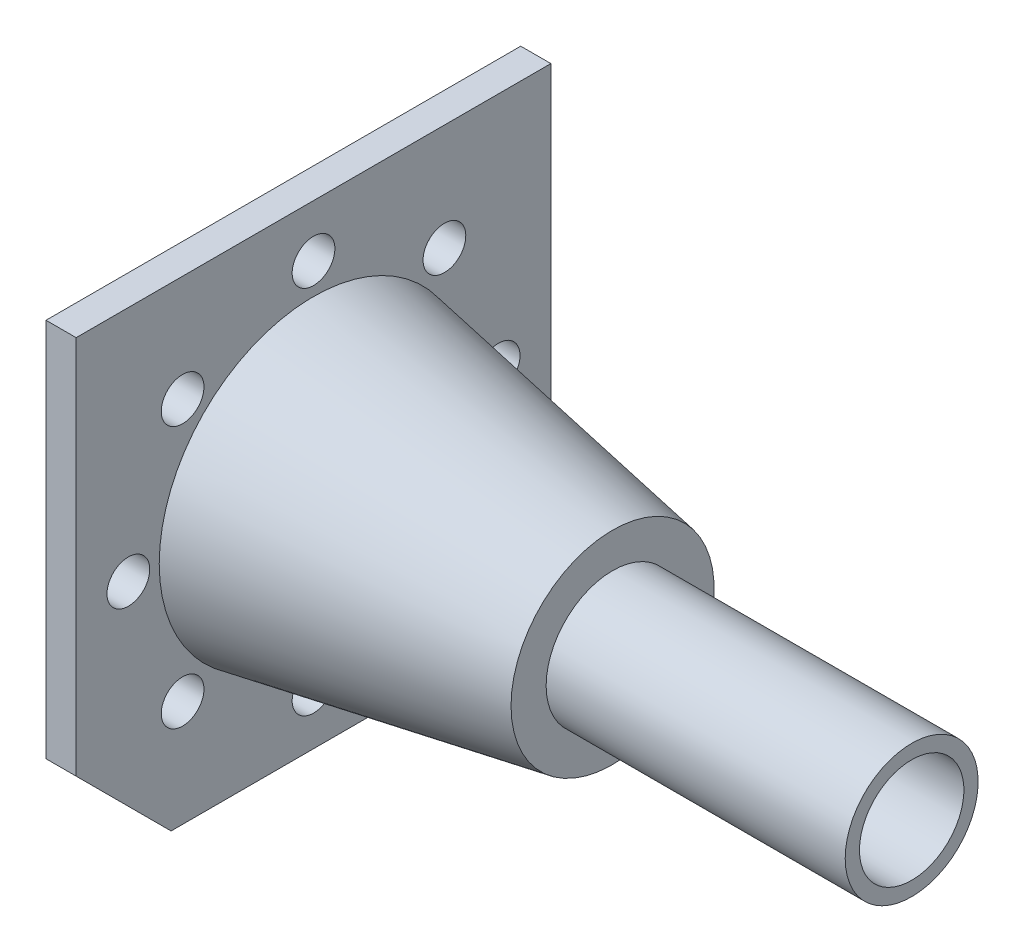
ISO-10303-21;
HEADER;
FILE_DESCRIPTION(('STEP AP214'),'2;1');
FILE_NAME('part.step','',(''),(''),'','','');
FILE_SCHEMA(('AUTOMOTIVE_DESIGN { 1 0 10303 214 1 1 1 1 }'));
ENDSEC;
DATA;
#1=APPLICATION_CONTEXT('core data for automotive mechanical design processes');
#2=APPLICATION_PROTOCOL_DEFINITION('international standard','automotive_design',2000,#1);
#3=PRODUCT_CONTEXT('',#1,'mechanical');
#4=PRODUCT('Part','Part','',(#3));
#5=PRODUCT_RELATED_PRODUCT_CATEGORY('part','',(#4));
#6=PRODUCT_DEFINITION_FORMATION('','',#4);
#7=PRODUCT_DEFINITION_CONTEXT('part definition',#1,'design');
#8=PRODUCT_DEFINITION('design','',#6,#7);
#9=PRODUCT_DEFINITION_SHAPE('','',#8);
#10=(LENGTH_UNIT() NAMED_UNIT(*) SI_UNIT(.MILLI.,.METRE.));
#11=(NAMED_UNIT(*) PLANE_ANGLE_UNIT() SI_UNIT($,.RADIAN.));
#12=(NAMED_UNIT(*) SI_UNIT($,.STERADIAN.) SOLID_ANGLE_UNIT());
#13=UNCERTAINTY_MEASURE_WITH_UNIT(LENGTH_MEASURE(1.E-05),#10,'distance_accuracy_value','');
#14=(GEOMETRIC_REPRESENTATION_CONTEXT(3) GLOBAL_UNCERTAINTY_ASSIGNED_CONTEXT((#13)) GLOBAL_UNIT_ASSIGNED_CONTEXT((#10,
#11,#12)) REPRESENTATION_CONTEXT('',''));
#15=CARTESIAN_POINT('',(0.,0.,0.));
#16=DIRECTION('',(0.,0.,1.));
#17=DIRECTION('',(1.,0.,0.));
#18=AXIS2_PLACEMENT_3D('',#15,#16,#17);
#19=CARTESIAN_POINT('',(6.35,-50.,50.));
#20=DIRECTION('',(0.,1.,0.));
#21=DIRECTION('',(0.,0.,1.));
#22=AXIS2_PLACEMENT_3D('',#19,#20,#21);
#23=PLANE('',#22);
#24=DIRECTION('',(0.,0.,-1.));
#25=VECTOR('',#24,1.);
#26=CARTESIAN_POINT('',(6.35,-50.,50.));
#27=LINE('',#26,#25);
#28=CARTESIAN_POINT('',(6.35,-50.,30.));
#29=VERTEX_POINT('',#28);
#30=CARTESIAN_POINT('',(6.35,-50.,-50.));
#31=VERTEX_POINT('',#30);
#32=EDGE_CURVE('E80',#29,#31,#27,.T.);
#33=ORIENTED_EDGE('',*,*,#32,.F.);
#34=DIRECTION('',(-1.,0.,0.));
#35=VECTOR('',#34,1.);
#36=CARTESIAN_POINT('',(6.35,-50.,30.));
#37=LINE('',#36,#35);
#38=CARTESIAN_POINT('',(0.,-50.,30.));
#39=VERTEX_POINT('',#38);
#40=EDGE_CURVE('E106',#29,#39,#37,.T.);
#41=ORIENTED_EDGE('',*,*,#40,.T.);
#42=DIRECTION('',(0.,0.,-1.));
#43=VECTOR('',#42,1.);
#44=CARTESIAN_POINT('',(0.,-50.,50.));
#45=LINE('',#44,#43);
#46=CARTESIAN_POINT('',(0.,-50.,-50.));
#47=VERTEX_POINT('',#46);
#48=EDGE_CURVE('E101',#39,#47,#45,.T.);
#49=ORIENTED_EDGE('',*,*,#48,.T.);
#50=DIRECTION('',(-1.,0.,0.));
#51=VECTOR('',#50,1.);
#52=CARTESIAN_POINT('',(6.35,-50.,-50.));
#53=LINE('',#52,#51);
#54=EDGE_CURVE('E95',#31,#47,#53,.T.);
#55=ORIENTED_EDGE('',*,*,#54,.F.);
#56=EDGE_LOOP('',(#33,#41,#49,#55));
#57=FACE_BOUND('',#56,.T.);
#58=ADVANCED_FACE('F34',(#57),#23,.F.);
#59=CARTESIAN_POINT('',(6.35,50.,-50.));
#60=DIRECTION('',(0.,0.,1.));
#61=DIRECTION('',(1.,0.,0.));
#62=AXIS2_PLACEMENT_3D('',#59,#60,#61);
#63=PLANE('',#62);
#64=DIRECTION('',(0.,1.,0.));
#65=VECTOR('',#64,1.);
#66=CARTESIAN_POINT('',(0.,50.,-50.));
#67=LINE('',#66,#65);
#68=CARTESIAN_POINT('',(0.,50.,-50.));
#69=VERTEX_POINT('',#68);
#70=EDGE_CURVE('E116',#47,#69,#67,.T.);
#71=ORIENTED_EDGE('',*,*,#70,.T.);
#72=DIRECTION('',(-1.,0.,0.));
#73=VECTOR('',#72,1.);
#74=CARTESIAN_POINT('',(6.35,50.,-50.));
#75=LINE('',#74,#73);
#76=CARTESIAN_POINT('',(6.35,50.,-50.));
#77=VERTEX_POINT('',#76);
#78=EDGE_CURVE('E97',#77,#69,#75,.T.);
#79=ORIENTED_EDGE('',*,*,#78,.F.);
#80=DIRECTION('',(0.,1.,0.));
#81=VECTOR('',#80,1.);
#82=CARTESIAN_POINT('',(6.35,50.,-50.));
#83=LINE('',#82,#81);
#84=EDGE_CURVE('E83',#31,#77,#83,.T.);
#85=ORIENTED_EDGE('',*,*,#84,.F.);
#86=ORIENTED_EDGE('',*,*,#54,.T.);
#87=EDGE_LOOP('',(#71,#79,#85,#86));
#88=FACE_BOUND('',#87,.T.);
#89=ADVANCED_FACE('F94',(#88),#63,.F.);
#90=CARTESIAN_POINT('',(6.35,50.,50.));
#91=DIRECTION('',(0.,-1.,0.));
#92=DIRECTION('',(0.,0.,-1.));
#93=AXIS2_PLACEMENT_3D('',#90,#91,#92);
#94=PLANE('',#93);
#95=DIRECTION('',(0.,0.,1.));
#96=VECTOR('',#95,1.);
#97=CARTESIAN_POINT('',(0.,50.,50.));
#98=LINE('',#97,#96);
#99=CARTESIAN_POINT('',(0.,50.,50.));
#100=VERTEX_POINT('',#99);
#101=EDGE_CURVE('E119',#69,#100,#98,.T.);
#102=ORIENTED_EDGE('',*,*,#101,.T.);
#103=DIRECTION('',(-1.,0.,0.));
#104=VECTOR('',#103,1.);
#105=CARTESIAN_POINT('',(6.35,50.,50.));
#106=LINE('',#105,#104);
#107=CARTESIAN_POINT('',(6.35,50.,50.));
#108=VERTEX_POINT('',#107);
#109=EDGE_CURVE('E108',#108,#100,#106,.T.);
#110=ORIENTED_EDGE('',*,*,#109,.F.);
#111=DIRECTION('',(0.,0.,1.));
#112=VECTOR('',#111,1.);
#113=CARTESIAN_POINT('',(6.35,50.,50.));
#114=LINE('',#113,#112);
#115=EDGE_CURVE('E99',#77,#108,#114,.T.);
#116=ORIENTED_EDGE('',*,*,#115,.F.);
#117=ORIENTED_EDGE('',*,*,#78,.T.);
#118=EDGE_LOOP('',(#102,#110,#116,#117));
#119=FACE_BOUND('',#118,.T.);
#120=ADVANCED_FACE('F217',(#119),#94,.F.);
#121=CARTESIAN_POINT('',(6.35,50.,50.));
#122=DIRECTION('',(0.,0.,-1.));
#123=DIRECTION('',(-1.,0.,0.));
#124=AXIS2_PLACEMENT_3D('',#121,#122,#123);
#125=PLANE('',#124);
#126=DIRECTION('',(0.,-1.,0.));
#127=VECTOR('',#126,1.);
#128=CARTESIAN_POINT('',(0.,50.,50.));
#129=LINE('',#128,#127);
#130=CARTESIAN_POINT('',(0.,-29.9999999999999,50.));
#131=VERTEX_POINT('',#130);
#132=EDGE_CURVE('E90',#100,#131,#129,.T.);
#133=ORIENTED_EDGE('',*,*,#132,.T.);
#134=DIRECTION('',(1.,0.,0.));
#135=VECTOR('',#134,1.);
#136=CARTESIAN_POINT('',(6.35,-29.9999999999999,50.));
#137=LINE('',#136,#135);
#138=CARTESIAN_POINT('',(6.35,-29.9999999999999,50.));
#139=VERTEX_POINT('',#138);
#140=EDGE_CURVE('E42',#131,#139,#137,.T.);
#141=ORIENTED_EDGE('',*,*,#140,.T.);
#142=DIRECTION('',(0.,-1.,0.));
#143=VECTOR('',#142,1.);
#144=CARTESIAN_POINT('',(6.35,50.,50.));
#145=LINE('',#144,#143);
#146=EDGE_CURVE('E125',#108,#139,#145,.T.);
#147=ORIENTED_EDGE('',*,*,#146,.F.);
#148=ORIENTED_EDGE('',*,*,#109,.T.);
#149=EDGE_LOOP('',(#133,#141,#147,#148));
#150=FACE_BOUND('',#149,.T.);
#151=ADVANCED_FACE('F222',(#150),#125,.F.);
#152=CARTESIAN_POINT('',(6.35,-50.,-50.));
#153=DIRECTION('',(-1.,0.,0.));
#154=DIRECTION('',(0.,0.,1.));
#155=AXIS2_PLACEMENT_3D('',#152,#153,#154);
#156=PLANE('',#155);
#157=CARTESIAN_POINT('',(6.35,27.5771644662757,-27.577164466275));
#158=DIRECTION('',(1.,0.,0.));
#159=DIRECTION('',(0.,0.707106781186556,-0.707106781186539));
#160=AXIS2_PLACEMENT_3D('',#157,#158,#159);
#161=CIRCLE('',#160,4.5);
#162=CARTESIAN_POINT('',(6.35,30.7591449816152,-30.7591449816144));
#163=VERTEX_POINT('',#162);
#164=EDGE_CURVE('E177',#163,#163,#161,.T.);
#165=ORIENTED_EDGE('',*,*,#164,.F.);
#166=EDGE_LOOP('',(#165));
#167=FACE_BOUND('',#166,.T.);
#168=CARTESIAN_POINT('',(6.35,4.08503316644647E-13,-39.));
#169=DIRECTION('',(1.,0.,0.));
#170=DIRECTION('',(0.,0.,-1.));
#171=AXIS2_PLACEMENT_3D('',#168,#169,#170);
#172=CIRCLE('',#171,4.5);
#173=CARTESIAN_POINT('',(6.35,4.55638314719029E-13,-43.5));
#174=VERTEX_POINT('',#173);
#175=EDGE_CURVE('E171',#174,#174,#172,.T.);
#176=ORIENTED_EDGE('',*,*,#175,.F.);
#177=EDGE_LOOP('',(#176));
#178=FACE_BOUND('',#177,.T.);
#179=CARTESIAN_POINT('',(6.35,-27.5771644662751,-27.5771644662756));
#180=DIRECTION('',(1.,0.,0.));
#181=DIRECTION('',(0.,-0.707106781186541,-0.707106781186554));
#182=AXIS2_PLACEMENT_3D('',#179,#180,#181);
#183=CIRCLE('',#182,4.5);
#184=CARTESIAN_POINT('',(6.35,-30.7591449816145,-30.7591449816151));
#185=VERTEX_POINT('',#184);
#186=EDGE_CURVE('E165',#185,#185,#183,.T.);
#187=ORIENTED_EDGE('',*,*,#186,.F.);
#188=EDGE_LOOP('',(#187));
#189=FACE_BOUND('',#188,.T.);
#190=CARTESIAN_POINT('',(6.35,-39.,0.));
#191=DIRECTION('',(1.,0.,0.));
#192=DIRECTION('',(0.,-1.,0.));
#193=AXIS2_PLACEMENT_3D('',#190,#191,#192);
#194=CIRCLE('',#193,4.5);
#195=CARTESIAN_POINT('',(6.35,-43.5,0.));
#196=VERTEX_POINT('',#195);
#197=EDGE_CURVE('E159',#196,#196,#194,.T.);
#198=ORIENTED_EDGE('',*,*,#197,.F.);
#199=EDGE_LOOP('',(#198));
#200=FACE_BOUND('',#199,.T.);
#201=CARTESIAN_POINT('',(6.35,-27.5771644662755,27.5771644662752));
#202=DIRECTION('',(1.,0.,0.));
#203=DIRECTION('',(0.,-0.707106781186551,0.707106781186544));
#204=AXIS2_PLACEMENT_3D('',#201,#202,#203);
#205=CIRCLE('',#204,4.5);
#206=CARTESIAN_POINT('',(6.35,-30.759144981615,30.7591449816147));
#207=VERTEX_POINT('',#206);
#208=EDGE_CURVE('E153',#207,#207,#205,.T.);
#209=ORIENTED_EDGE('',*,*,#208,.F.);
#210=EDGE_LOOP('',(#209));
#211=FACE_BOUND('',#210,.T.);
#212=CARTESIAN_POINT('',(6.35,-1.36167772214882E-13,39.));
#213=DIRECTION('',(1.,0.,0.));
#214=DIRECTION('',(0.,0.,1.));
#215=AXIS2_PLACEMENT_3D('',#212,#213,#214);
#216=CIRCLE('',#215,4.5);
#217=CARTESIAN_POINT('',(6.35,-1.51879438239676E-13,43.5));
#218=VERTEX_POINT('',#217);
#219=EDGE_CURVE('E147',#218,#218,#216,.T.);
#220=ORIENTED_EDGE('',*,*,#219,.F.);
#221=EDGE_LOOP('',(#220));
#222=FACE_BOUND('',#221,.T.);
#223=CARTESIAN_POINT('',(6.35,27.5771644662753,27.5771644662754));
#224=DIRECTION('',(1.,0.,0.));
#225=DIRECTION('',(0.,0.707106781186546,0.707106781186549));
#226=AXIS2_PLACEMENT_3D('',#223,#224,#225);
#227=CIRCLE('',#226,4.5);
#228=CARTESIAN_POINT('',(6.35,30.7591449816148,30.7591449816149));
#229=VERTEX_POINT('',#228);
#230=EDGE_CURVE('E141',#229,#229,#227,.T.);
#231=ORIENTED_EDGE('',*,*,#230,.F.);
#232=EDGE_LOOP('',(#231));
#233=FACE_BOUND('',#232,.T.);
#234=CARTESIAN_POINT('',(6.35,39.,0.));
#235=DIRECTION('',(1.,0.,0.));
#236=DIRECTION('',(0.,1.,0.));
#237=AXIS2_PLACEMENT_3D('',#234,#235,#236);
#238=CIRCLE('',#237,4.5);
#239=CARTESIAN_POINT('',(6.35,43.5,0.));
#240=VERTEX_POINT('',#239);
#241=EDGE_CURVE('E135',#240,#240,#238,.T.);
#242=ORIENTED_EDGE('',*,*,#241,.F.);
#243=EDGE_LOOP('',(#242));
#244=FACE_BOUND('',#243,.T.);
#245=CARTESIAN_POINT('',(6.35,0.,0.));
#246=DIRECTION('',(-1.,0.,0.));
#247=DIRECTION('',(0.,0.,1.));
#248=AXIS2_PLACEMENT_3D('',#245,#246,#247);
#249=CIRCLE('',#248,32.5);
#250=CARTESIAN_POINT('',(6.35,0.,32.5));
#251=VERTEX_POINT('',#250);
#252=EDGE_CURVE('E122',#251,#251,#249,.T.);
#253=ORIENTED_EDGE('',*,*,#252,.T.);
#254=EDGE_LOOP('',(#253));
#255=FACE_BOUND('',#254,.T.);
#256=ORIENTED_EDGE('',*,*,#146,.T.);
#257=DIRECTION('',(0.,0.707106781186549,0.707106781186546));
#258=VECTOR('',#257,1.);
#259=CARTESIAN_POINT('',(6.35,-50.,30.));
#260=LINE('',#259,#258);
#261=EDGE_CURVE('E11',#139,#29,#260,.F.);
#262=ORIENTED_EDGE('',*,*,#261,.T.);
#263=ORIENTED_EDGE('',*,*,#32,.T.);
#264=ORIENTED_EDGE('',*,*,#84,.T.);
#265=ORIENTED_EDGE('',*,*,#115,.T.);
#266=EDGE_LOOP('',(#256,#262,#263,#264,#265));
#267=FACE_BOUND('',#266,.T.);
#268=ADVANCED_FACE('F82',(#167,#178,#189,#200,#211,#222,#233,#244,#255,#267),#156,.F.);
#269=CARTESIAN_POINT('',(0.,-50.,-50.));
#270=DIRECTION('',(-1.,0.,0.));
#271=DIRECTION('',(0.,0.,1.));
#272=AXIS2_PLACEMENT_3D('',#269,#270,#271);
#273=PLANE('',#272);
#274=CARTESIAN_POINT('',(0.,27.5771644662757,-27.577164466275));
#275=DIRECTION('',(1.,0.,0.));
#276=DIRECTION('',(0.,0.707106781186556,-0.707106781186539));
#277=AXIS2_PLACEMENT_3D('',#274,#275,#276);
#278=CIRCLE('',#277,4.5);
#279=CARTESIAN_POINT('',(0.,30.7591449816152,-30.7591449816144));
#280=VERTEX_POINT('',#279);
#281=EDGE_CURVE('E174',#280,#280,#278,.T.);
#282=ORIENTED_EDGE('',*,*,#281,.T.);
#283=EDGE_LOOP('',(#282));
#284=FACE_BOUND('',#283,.T.);
#285=CARTESIAN_POINT('',(0.,4.08503316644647E-13,-39.));
#286=DIRECTION('',(1.,0.,0.));
#287=DIRECTION('',(0.,0.,-1.));
#288=AXIS2_PLACEMENT_3D('',#285,#286,#287);
#289=CIRCLE('',#288,4.5);
#290=CARTESIAN_POINT('',(0.,4.55638314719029E-13,-43.5));
#291=VERTEX_POINT('',#290);
#292=EDGE_CURVE('E168',#291,#291,#289,.T.);
#293=ORIENTED_EDGE('',*,*,#292,.T.);
#294=EDGE_LOOP('',(#293));
#295=FACE_BOUND('',#294,.T.);
#296=CARTESIAN_POINT('',(0.,-27.5771644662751,-27.5771644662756));
#297=DIRECTION('',(1.,0.,0.));
#298=DIRECTION('',(0.,-0.707106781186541,-0.707106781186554));
#299=AXIS2_PLACEMENT_3D('',#296,#297,#298);
#300=CIRCLE('',#299,4.5);
#301=CARTESIAN_POINT('',(0.,-30.7591449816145,-30.7591449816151));
#302=VERTEX_POINT('',#301);
#303=EDGE_CURVE('E162',#302,#302,#300,.T.);
#304=ORIENTED_EDGE('',*,*,#303,.T.);
#305=EDGE_LOOP('',(#304));
#306=FACE_BOUND('',#305,.T.);
#307=CARTESIAN_POINT('',(0.,-39.,0.));
#308=DIRECTION('',(1.,0.,0.));
#309=DIRECTION('',(0.,-1.,0.));
#310=AXIS2_PLACEMENT_3D('',#307,#308,#309);
#311=CIRCLE('',#310,4.5);
#312=CARTESIAN_POINT('',(0.,-43.5,0.));
#313=VERTEX_POINT('',#312);
#314=EDGE_CURVE('E156',#313,#313,#311,.T.);
#315=ORIENTED_EDGE('',*,*,#314,.T.);
#316=EDGE_LOOP('',(#315));
#317=FACE_BOUND('',#316,.T.);
#318=CARTESIAN_POINT('',(0.,-27.5771644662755,27.5771644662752));
#319=DIRECTION('',(1.,0.,0.));
#320=DIRECTION('',(0.,-0.707106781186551,0.707106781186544));
#321=AXIS2_PLACEMENT_3D('',#318,#319,#320);
#322=CIRCLE('',#321,4.5);
#323=CARTESIAN_POINT('',(0.,-30.759144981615,30.7591449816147));
#324=VERTEX_POINT('',#323);
#325=EDGE_CURVE('E150',#324,#324,#322,.T.);
#326=ORIENTED_EDGE('',*,*,#325,.T.);
#327=EDGE_LOOP('',(#326));
#328=FACE_BOUND('',#327,.T.);
#329=CARTESIAN_POINT('',(0.,-1.36167772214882E-13,39.));
#330=DIRECTION('',(1.,0.,0.));
#331=DIRECTION('',(0.,0.,1.));
#332=AXIS2_PLACEMENT_3D('',#329,#330,#331);
#333=CIRCLE('',#332,4.5);
#334=CARTESIAN_POINT('',(0.,-1.51879438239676E-13,43.5));
#335=VERTEX_POINT('',#334);
#336=EDGE_CURVE('E144',#335,#335,#333,.T.);
#337=ORIENTED_EDGE('',*,*,#336,.T.);
#338=EDGE_LOOP('',(#337));
#339=FACE_BOUND('',#338,.T.);
#340=CARTESIAN_POINT('',(0.,27.5771644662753,27.5771644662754));
#341=DIRECTION('',(1.,0.,0.));
#342=DIRECTION('',(0.,0.707106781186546,0.707106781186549));
#343=AXIS2_PLACEMENT_3D('',#340,#341,#342);
#344=CIRCLE('',#343,4.5);
#345=CARTESIAN_POINT('',(0.,30.7591449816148,30.7591449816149));
#346=VERTEX_POINT('',#345);
#347=EDGE_CURVE('E138',#346,#346,#344,.T.);
#348=ORIENTED_EDGE('',*,*,#347,.T.);
#349=EDGE_LOOP('',(#348));
#350=FACE_BOUND('',#349,.T.);
#351=CARTESIAN_POINT('',(0.,39.,0.));
#352=DIRECTION('',(1.,0.,0.));
#353=DIRECTION('',(0.,1.,0.));
#354=AXIS2_PLACEMENT_3D('',#351,#352,#353);
#355=CIRCLE('',#354,4.5);
#356=CARTESIAN_POINT('',(0.,43.5,0.));
#357=VERTEX_POINT('',#356);
#358=EDGE_CURVE('E134',#357,#357,#355,.T.);
#359=ORIENTED_EDGE('',*,*,#358,.T.);
#360=EDGE_LOOP('',(#359));
#361=FACE_BOUND('',#360,.T.);
#362=ORIENTED_EDGE('',*,*,#48,.F.);
#363=DIRECTION('',(0.,-0.707106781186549,-0.707106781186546));
#364=VECTOR('',#363,1.);
#365=CARTESIAN_POINT('',(0.,-90.,-9.99999999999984));
#366=LINE('',#365,#364);
#367=EDGE_CURVE('E56',#39,#131,#366,.F.);
#368=ORIENTED_EDGE('',*,*,#367,.T.);
#369=ORIENTED_EDGE('',*,*,#132,.F.);
#370=ORIENTED_EDGE('',*,*,#101,.F.);
#371=ORIENTED_EDGE('',*,*,#70,.F.);
#372=EDGE_LOOP('',(#362,#368,#369,#370,#371));
#373=FACE_BOUND('',#372,.T.);
#374=ADVANCED_FACE('F114',(#284,#295,#306,#317,#328,#339,#350,#361,#373),#273,.T.);
#375=CARTESIAN_POINT('',(69.35,0.,0.));
#376=DIRECTION('',(1.,0.,0.));
#377=DIRECTION('',(0.,0.,-1.));
#378=AXIS2_PLACEMENT_3D('',#375,#376,#377);
#379=PLANE('',#378);
#380=CARTESIAN_POINT('',(69.35,0.,0.));
#381=DIRECTION('',(1.,0.,0.));
#382=DIRECTION('',(0.,0.,-1.));
#383=AXIS2_PLACEMENT_3D('',#380,#381,#382);
#384=CIRCLE('',#383,14.);
#385=CARTESIAN_POINT('',(69.35,0.,-14.));
#386=VERTEX_POINT('',#385);
#387=EDGE_CURVE('E103',#386,#386,#384,.T.);
#388=ORIENTED_EDGE('',*,*,#387,.F.);
#389=EDGE_LOOP('',(#388));
#390=FACE_BOUND('',#389,.T.);
#391=CARTESIAN_POINT('',(69.35,0.,0.));
#392=DIRECTION('',(-1.,0.,0.));
#393=DIRECTION('',(0.,0.,1.));
#394=AXIS2_PLACEMENT_3D('',#391,#392,#393);
#395=CIRCLE('',#394,21.3914002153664);
#396=CARTESIAN_POINT('',(69.35,0.,21.3914002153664));
#397=VERTEX_POINT('',#396);
#398=EDGE_CURVE('E117',#397,#397,#395,.T.);
#399=ORIENTED_EDGE('',*,*,#398,.F.);
#400=EDGE_LOOP('',(#399));
#401=FACE_BOUND('',#400,.T.);
#402=ADVANCED_FACE('F204',(#390,#401),#379,.T.);
#403=CARTESIAN_POINT('',(6.35,0.,0.));
#404=DIRECTION('',(-1.,0.,0.));
#405=DIRECTION('',(0.,0.,1.));
#406=AXIS2_PLACEMENT_3D('',#403,#404,#405);
#407=CONICAL_SURFACE('',#406,32.5,0.174532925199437);
#408=ORIENTED_EDGE('',*,*,#398,.T.);
#409=EDGE_LOOP('',(#408));
#410=FACE_BOUND('',#409,.T.);
#411=ORIENTED_EDGE('',*,*,#252,.F.);
#412=EDGE_LOOP('',(#411));
#413=FACE_BOUND('',#412,.T.);
#414=ADVANCED_FACE('F211',(#410,#413),#407,.T.);
#415=CARTESIAN_POINT('',(0.,39.,0.));
#416=DIRECTION('',(1.,0.,0.));
#417=DIRECTION('',(0.,1.,0.));
#418=AXIS2_PLACEMENT_3D('',#415,#416,#417);
#419=CYLINDRICAL_SURFACE('',#418,4.5);
#420=ORIENTED_EDGE('',*,*,#358,.F.);
#421=EDGE_LOOP('',(#420));
#422=FACE_BOUND('',#421,.T.);
#423=ORIENTED_EDGE('',*,*,#241,.T.);
#424=EDGE_LOOP('',(#423));
#425=FACE_BOUND('',#424,.T.);
#426=ADVANCED_FACE('F251',(#422,#425),#419,.F.);
#427=CARTESIAN_POINT('',(0.,27.5771644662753,27.5771644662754));
#428=DIRECTION('',(1.,0.,0.));
#429=DIRECTION('',(0.,0.,-1.));
#430=AXIS2_PLACEMENT_3D('',#427,#428,#429);
#431=CYLINDRICAL_SURFACE('',#430,4.5);
#432=ORIENTED_EDGE('',*,*,#347,.F.);
#433=EDGE_LOOP('',(#432));
#434=FACE_BOUND('',#433,.T.);
#435=ORIENTED_EDGE('',*,*,#230,.T.);
#436=EDGE_LOOP('',(#435));
#437=FACE_BOUND('',#436,.T.);
#438=ADVANCED_FACE('F256',(#434,#437),#431,.F.);
#439=CARTESIAN_POINT('',(0.,-1.36167772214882E-13,39.));
#440=DIRECTION('',(1.,0.,0.));
#441=DIRECTION('',(0.,0.,-1.));
#442=AXIS2_PLACEMENT_3D('',#439,#440,#441);
#443=CYLINDRICAL_SURFACE('',#442,4.5);
#444=ORIENTED_EDGE('',*,*,#336,.F.);
#445=EDGE_LOOP('',(#444));
#446=FACE_BOUND('',#445,.T.);
#447=ORIENTED_EDGE('',*,*,#219,.T.);
#448=EDGE_LOOP('',(#447));
#449=FACE_BOUND('',#448,.T.);
#450=ADVANCED_FACE('F262',(#446,#449),#443,.F.);
#451=CARTESIAN_POINT('',(0.,-27.5771644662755,27.5771644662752));
#452=DIRECTION('',(1.,0.,0.));
#453=DIRECTION('',(0.,1.,0.));
#454=AXIS2_PLACEMENT_3D('',#451,#452,#453);
#455=CYLINDRICAL_SURFACE('',#454,4.5);
#456=ORIENTED_EDGE('',*,*,#325,.F.);
#457=EDGE_LOOP('',(#456));
#458=FACE_BOUND('',#457,.T.);
#459=ORIENTED_EDGE('',*,*,#208,.T.);
#460=EDGE_LOOP('',(#459));
#461=FACE_BOUND('',#460,.T.);
#462=ADVANCED_FACE('F266',(#458,#461),#455,.F.);
#463=CARTESIAN_POINT('',(0.,-39.,0.));
#464=DIRECTION('',(1.,0.,0.));
#465=DIRECTION('',(0.,1.,0.));
#466=AXIS2_PLACEMENT_3D('',#463,#464,#465);
#467=CYLINDRICAL_SURFACE('',#466,4.5);
#468=ORIENTED_EDGE('',*,*,#314,.F.);
#469=EDGE_LOOP('',(#468));
#470=FACE_BOUND('',#469,.T.);
#471=ORIENTED_EDGE('',*,*,#197,.T.);
#472=EDGE_LOOP('',(#471));
#473=FACE_BOUND('',#472,.T.);
#474=ADVANCED_FACE('F270',(#470,#473),#467,.F.);
#475=CARTESIAN_POINT('',(0.,-27.5771644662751,-27.5771644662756));
#476=DIRECTION('',(1.,0.,0.));
#477=DIRECTION('',(0.,0.,-1.));
#478=AXIS2_PLACEMENT_3D('',#475,#476,#477);
#479=CYLINDRICAL_SURFACE('',#478,4.5);
#480=ORIENTED_EDGE('',*,*,#303,.F.);
#481=EDGE_LOOP('',(#480));
#482=FACE_BOUND('',#481,.T.);
#483=ORIENTED_EDGE('',*,*,#186,.T.);
#484=EDGE_LOOP('',(#483));
#485=FACE_BOUND('',#484,.T.);
#486=ADVANCED_FACE('F274',(#482,#485),#479,.F.);
#487=CARTESIAN_POINT('',(0.,4.08503316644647E-13,-39.));
#488=DIRECTION('',(1.,0.,0.));
#489=DIRECTION('',(0.,0.,-1.));
#490=AXIS2_PLACEMENT_3D('',#487,#488,#489);
#491=CYLINDRICAL_SURFACE('',#490,4.5);
#492=ORIENTED_EDGE('',*,*,#292,.F.);
#493=EDGE_LOOP('',(#492));
#494=FACE_BOUND('',#493,.T.);
#495=ORIENTED_EDGE('',*,*,#175,.T.);
#496=EDGE_LOOP('',(#495));
#497=FACE_BOUND('',#496,.T.);
#498=ADVANCED_FACE('F278',(#494,#497),#491,.F.);
#499=CARTESIAN_POINT('',(0.,27.5771644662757,-27.577164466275));
#500=DIRECTION('',(1.,0.,0.));
#501=DIRECTION('',(0.,1.,0.));
#502=AXIS2_PLACEMENT_3D('',#499,#500,#501);
#503=CYLINDRICAL_SURFACE('',#502,4.5);
#504=ORIENTED_EDGE('',*,*,#281,.F.);
#505=EDGE_LOOP('',(#504));
#506=FACE_BOUND('',#505,.T.);
#507=ORIENTED_EDGE('',*,*,#164,.T.);
#508=EDGE_LOOP('',(#507));
#509=FACE_BOUND('',#508,.T.);
#510=ADVANCED_FACE('F282',(#506,#509),#503,.F.);
#511=CARTESIAN_POINT('',(132.35,0.,0.));
#512=DIRECTION('',(-1.,0.,0.));
#513=DIRECTION('',(0.,0.,1.));
#514=AXIS2_PLACEMENT_3D('',#511,#512,#513);
#515=CYLINDRICAL_SURFACE('',#514,14.);
#516=CARTESIAN_POINT('',(132.35,0.,0.));
#517=DIRECTION('',(-1.,0.,0.));
#518=DIRECTION('',(0.,0.,1.));
#519=AXIS2_PLACEMENT_3D('',#516,#517,#518);
#520=CIRCLE('',#519,14.);
#521=CARTESIAN_POINT('',(132.35,0.,14.));
#522=VERTEX_POINT('',#521);
#523=EDGE_CURVE('E180',#522,#522,#520,.T.);
#524=ORIENTED_EDGE('',*,*,#523,.T.);
#525=EDGE_LOOP('',(#524));
#526=FACE_BOUND('',#525,.T.);
#527=ORIENTED_EDGE('',*,*,#387,.T.);
#528=EDGE_LOOP('',(#527));
#529=FACE_BOUND('',#528,.T.);
#530=ADVANCED_FACE('F286',(#526,#529),#515,.T.);
#531=CARTESIAN_POINT('',(132.35,0.,0.));
#532=DIRECTION('',(-1.,0.,0.));
#533=DIRECTION('',(0.,0.,1.));
#534=AXIS2_PLACEMENT_3D('',#531,#532,#533);
#535=PLANE('',#534);
#536=CARTESIAN_POINT('',(132.35,0.,0.));
#537=DIRECTION('',(-1.,0.,0.));
#538=DIRECTION('',(0.,0.,1.));
#539=AXIS2_PLACEMENT_3D('',#536,#537,#538);
#540=CIRCLE('',#539,11.);
#541=CARTESIAN_POINT('',(132.35,0.,11.));
#542=VERTEX_POINT('',#541);
#543=EDGE_CURVE('E185',#542,#542,#540,.T.);
#544=ORIENTED_EDGE('',*,*,#543,.T.);
#545=EDGE_LOOP('',(#544));
#546=FACE_BOUND('',#545,.T.);
#547=ORIENTED_EDGE('',*,*,#523,.F.);
#548=EDGE_LOOP('',(#547));
#549=FACE_BOUND('',#548,.T.);
#550=ADVANCED_FACE('F192',(#546,#549),#535,.F.);
#551=CARTESIAN_POINT('',(132.35,0.,0.));
#552=DIRECTION('',(-1.,0.,0.));
#553=DIRECTION('',(0.,0.,1.));
#554=AXIS2_PLACEMENT_3D('',#551,#552,#553);
#555=CYLINDRICAL_SURFACE('',#554,11.);
#556=ORIENTED_EDGE('',*,*,#543,.F.);
#557=EDGE_LOOP('',(#556));
#558=FACE_BOUND('',#557,.T.);
#559=CARTESIAN_POINT('',(69.35,0.,0.));
#560=DIRECTION('',(-1.,0.,0.));
#561=DIRECTION('',(0.,0.,1.));
#562=AXIS2_PLACEMENT_3D('',#559,#560,#561);
#563=CIRCLE('',#562,11.);
#564=CARTESIAN_POINT('',(69.35,0.,11.));
#565=VERTEX_POINT('',#564);
#566=EDGE_CURVE('E186',#565,#565,#563,.T.);
#567=ORIENTED_EDGE('',*,*,#566,.T.);
#568=EDGE_LOOP('',(#567));
#569=FACE_BOUND('',#568,.T.);
#570=ADVANCED_FACE('F195',(#558,#569),#555,.F.);
#571=ORIENTED_EDGE('',*,*,#566,.F.);
#572=EDGE_LOOP('',(#571));
#573=FACE_BOUND('',#572,.T.);
#574=ADVANCED_FACE('F198',(#573),#379,.T.);
#575=CARTESIAN_POINT('',(6.35,-50.,30.));
#576=DIRECTION('',(0.,0.707106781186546,-0.707106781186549));
#577=DIRECTION('',(0.,0.707106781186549,0.707106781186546));
#578=AXIS2_PLACEMENT_3D('',#575,#576,#577);
#579=PLANE('',#578);
#580=ORIENTED_EDGE('',*,*,#261,.F.);
#581=ORIENTED_EDGE('',*,*,#140,.F.);
#582=ORIENTED_EDGE('',*,*,#367,.F.);
#583=ORIENTED_EDGE('',*,*,#40,.F.);
#584=EDGE_LOOP('',(#580,#581,#582,#583));
#585=FACE_BOUND('',#584,.T.);
#586=ADVANCED_FACE('F36',(#585),#579,.F.);
#587=CLOSED_SHELL('',(#58,#89,#120,#151,#268,#374,#402,#414,#426,#438,#450,#462,#474,#486,#498,
#510,#530,#550,#570,#574,#586));
#588=MANIFOLD_SOLID_BREP('B2',#587);
#589=ADVANCED_BREP_SHAPE_REPRESENTATION('',(#18,#588),#14);
#590=SHAPE_DEFINITION_REPRESENTATION(#9,#589);
ENDSEC;
END-ISO-10303-21;
